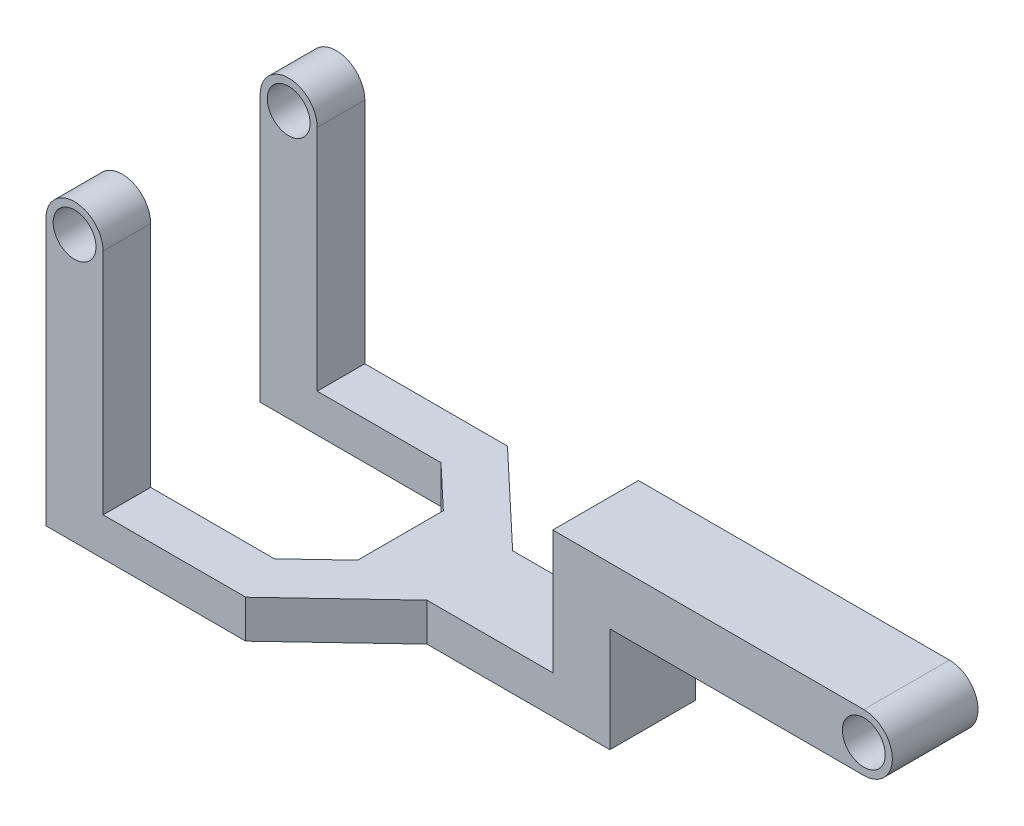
ISO-10303-21;
HEADER;
FILE_DESCRIPTION(('STEP AP214'),'2;1');
FILE_NAME('part.step','',(''),(''),'','','');
FILE_SCHEMA(('AUTOMOTIVE_DESIGN { 1 0 10303 214 1 1 1 1 }'));
ENDSEC;
DATA;
#1=APPLICATION_CONTEXT('core data for automotive mechanical design processes');
#2=APPLICATION_PROTOCOL_DEFINITION('international standard','automotive_design',2000,#1);
#3=PRODUCT_CONTEXT('',#1,'mechanical');
#4=PRODUCT('Part','Part','',(#3));
#5=PRODUCT_RELATED_PRODUCT_CATEGORY('part','',(#4));
#6=PRODUCT_DEFINITION_FORMATION('','',#4);
#7=PRODUCT_DEFINITION_CONTEXT('part definition',#1,'design');
#8=PRODUCT_DEFINITION('design','',#6,#7);
#9=PRODUCT_DEFINITION_SHAPE('','',#8);
#10=(LENGTH_UNIT() NAMED_UNIT(*) SI_UNIT(.MILLI.,.METRE.));
#11=(NAMED_UNIT(*) PLANE_ANGLE_UNIT() SI_UNIT($,.RADIAN.));
#12=(NAMED_UNIT(*) SI_UNIT($,.STERADIAN.) SOLID_ANGLE_UNIT());
#13=UNCERTAINTY_MEASURE_WITH_UNIT(LENGTH_MEASURE(1.E-05),#10,'distance_accuracy_value','');
#14=(GEOMETRIC_REPRESENTATION_CONTEXT(3) GLOBAL_UNCERTAINTY_ASSIGNED_CONTEXT((#13)) GLOBAL_UNIT_ASSIGNED_CONTEXT((#10,
#11,#12)) REPRESENTATION_CONTEXT('',''));
#15=CARTESIAN_POINT('',(0.,0.,0.));
#16=DIRECTION('',(0.,0.,1.));
#17=DIRECTION('',(1.,0.,0.));
#18=AXIS2_PLACEMENT_3D('',#15,#16,#17);
#19=CARTESIAN_POINT('',(0.,0.,275.));
#20=DIRECTION('',(0.,1.,0.));
#21=DIRECTION('',(0.,0.,1.));
#22=AXIS2_PLACEMENT_3D('',#19,#20,#21);
#23=PLANE('',#22);
#24=DIRECTION('',(0.727013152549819,0.,-0.686623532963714));
#25=VECTOR('',#24,1.);
#26=CARTESIAN_POINT('',(98.9478161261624,0.,379.76827589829));
#27=LINE('',#26,#25);
#28=CARTESIAN_POINT('',(209.878931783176,0.,275.));
#29=VERTEX_POINT('',#28);
#30=CARTESIAN_POINT('',(307.820108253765,0.,182.5));
#31=VERTEX_POINT('',#30);
#32=EDGE_CURVE('E195',#29,#31,#27,.T.);
#33=ORIENTED_EDGE('',*,*,#32,.F.);
#34=DIRECTION('',(1.,0.,0.));
#35=VECTOR('',#34,1.);
#36=CARTESIAN_POINT('',(0.,0.,275.));
#37=LINE('',#36,#35);
#38=CARTESIAN_POINT('',(0.,0.,275.));
#39=VERTEX_POINT('',#38);
#40=EDGE_CURVE('E297',#39,#29,#37,.T.);
#41=ORIENTED_EDGE('',*,*,#40,.F.);
#42=DIRECTION('',(0.,0.,-1.));
#43=VECTOR('',#42,1.);
#44=CARTESIAN_POINT('',(0.,0.,275.));
#45=LINE('',#44,#43);
#46=CARTESIAN_POINT('',(0.,0.,225.));
#47=VERTEX_POINT('',#46);
#48=EDGE_CURVE('E335',#39,#47,#45,.T.);
#49=ORIENTED_EDGE('',*,*,#48,.T.);
#50=DIRECTION('',(-1.,0.,0.));
#51=VECTOR('',#50,1.);
#52=CARTESIAN_POINT('',(0.,0.,225.));
#53=LINE('',#52,#51);
#54=CARTESIAN_POINT('',(190.,0.,225.));
#55=VERTEX_POINT('',#54);
#56=EDGE_CURVE('E276',#55,#47,#53,.T.);
#57=ORIENTED_EDGE('',*,*,#56,.F.);
#58=DIRECTION('',(-0.727013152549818,0.,0.686623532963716));
#59=VECTOR('',#58,1.);
#60=CARTESIAN_POINT('',(64.6166394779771,0.,343.417618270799));
#61=LINE('',#60,#59);
#62=CARTESIAN_POINT('',(235.,0.,182.5));
#63=VERTEX_POINT('',#62);
#64=EDGE_CURVE('E282',#63,#55,#61,.T.);
#65=ORIENTED_EDGE('',*,*,#64,.F.);
#66=DIRECTION('',(0.,0.,1.));
#67=VECTOR('',#66,1.);
#68=CARTESIAN_POINT('',(235.,0.,275.));
#69=LINE('',#68,#67);
#70=CARTESIAN_POINT('',(235.,0.,92.5000000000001));
#71=VERTEX_POINT('',#70);
#72=EDGE_CURVE('E280',#71,#63,#69,.T.);
#73=ORIENTED_EDGE('',*,*,#72,.F.);
#74=DIRECTION('',(0.727013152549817,0.,0.686623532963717));
#75=VECTOR('',#74,1.);
#76=CARTESIAN_POINT('',(201.89233278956,0.,61.2316476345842));
#77=LINE('',#76,#75);
#78=CARTESIAN_POINT('',(190.,0.,50.0000000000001));
#79=VERTEX_POINT('',#78);
#80=EDGE_CURVE('E278',#79,#71,#77,.T.);
#81=ORIENTED_EDGE('',*,*,#80,.F.);
#82=DIRECTION('',(1.,0.,0.));
#83=VECTOR('',#82,1.);
#84=CARTESIAN_POINT('',(0.,0.,50.));
#85=LINE('',#84,#83);
#86=CARTESIAN_POINT('',(0.,0.,50.));
#87=VERTEX_POINT('',#86);
#88=EDGE_CURVE('E267',#87,#79,#85,.T.);
#89=ORIENTED_EDGE('',*,*,#88,.F.);
#90=CARTESIAN_POINT('',(0.,0.,0.));
#91=VERTEX_POINT('',#90);
#92=EDGE_CURVE('E334',#87,#91,#45,.T.);
#93=ORIENTED_EDGE('',*,*,#92,.T.);
#94=DIRECTION('',(1.,0.,0.));
#95=VECTOR('',#94,1.);
#96=CARTESIAN_POINT('',(0.,0.,0.));
#97=LINE('',#96,#95);
#98=CARTESIAN_POINT('',(209.878931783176,0.,0.));
#99=VERTEX_POINT('',#98);
#100=EDGE_CURVE('E309',#91,#99,#97,.T.);
#101=ORIENTED_EDGE('',*,*,#100,.T.);
#102=DIRECTION('',(-0.727013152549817,0.,-0.686623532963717));
#103=VECTOR('',#102,1.);
#104=CARTESIAN_POINT('',(236.223509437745,0.,24.8809900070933));
#105=LINE('',#104,#103);
#106=CARTESIAN_POINT('',(307.820108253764,0.,92.5000000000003));
#107=VERTEX_POINT('',#106);
#108=EDGE_CURVE('E241',#107,#99,#105,.T.);
#109=ORIENTED_EDGE('',*,*,#108,.F.);
#110=DIRECTION('',(-1.,0.,0.));
#111=VECTOR('',#110,1.);
#112=CARTESIAN_POINT('',(0.,0.,92.5000000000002));
#113=LINE('',#112,#111);
#114=CARTESIAN_POINT('',(500.,0.,92.5000000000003));
#115=VERTEX_POINT('',#114);
#116=EDGE_CURVE('E237',#115,#107,#113,.T.);
#117=ORIENTED_EDGE('',*,*,#116,.F.);
#118=DIRECTION('',(0.,0.,-1.));
#119=VECTOR('',#118,1.);
#120=CARTESIAN_POINT('',(500.,0.,275.));
#121=LINE('',#120,#119);
#122=CARTESIAN_POINT('',(500.,0.,182.5));
#123=VERTEX_POINT('',#122);
#124=EDGE_CURVE('E332',#123,#115,#121,.T.);
#125=ORIENTED_EDGE('',*,*,#124,.F.);
#126=DIRECTION('',(1.,0.,0.));
#127=VECTOR('',#126,1.);
#128=CARTESIAN_POINT('',(0.,0.,182.5));
#129=LINE('',#128,#127);
#130=EDGE_CURVE('E190',#31,#123,#129,.T.);
#131=ORIENTED_EDGE('',*,*,#130,.F.);
#132=EDGE_LOOP('',(#33,#41,#49,#57,#65,#73,#81,#89,#93,#101,#109,#117,#125,#131));
#133=FACE_BOUND('',#132,.T.);
#134=ADVANCED_FACE('F33',(#133),#23,.F.);
#135=CARTESIAN_POINT('',(440.,40.,275.));
#136=DIRECTION('',(0.,-1.,0.));
#137=DIRECTION('',(1.,0.,0.));
#138=AXIS2_PLACEMENT_3D('',#135,#136,#137);
#139=PLANE('',#138);
#140=DIRECTION('',(-0.727013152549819,0.,0.686623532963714));
#141=VECTOR('',#140,1.);
#142=CARTESIAN_POINT('',(331.50899067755,40.,160.127166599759));
#143=LINE('',#142,#141);
#144=CARTESIAN_POINT('',(307.820108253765,40.,182.5));
#145=VERTEX_POINT('',#144);
#146=CARTESIAN_POINT('',(209.878931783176,40.,275.));
#147=VERTEX_POINT('',#146);
#148=EDGE_CURVE('E49',#145,#147,#143,.T.);
#149=ORIENTED_EDGE('',*,*,#148,.F.);
#150=DIRECTION('',(-1.,0.,0.));
#151=VECTOR('',#150,1.);
#152=CARTESIAN_POINT('',(440.,40.,182.5));
#153=LINE('',#152,#151);
#154=CARTESIAN_POINT('',(440.,40.,182.5));
#155=VERTEX_POINT('',#154);
#156=EDGE_CURVE('E184',#155,#145,#153,.T.);
#157=ORIENTED_EDGE('',*,*,#156,.F.);
#158=DIRECTION('',(0.,0.,-1.));
#159=VECTOR('',#158,1.);
#160=CARTESIAN_POINT('',(440.,40.,275.));
#161=LINE('',#160,#159);
#162=CARTESIAN_POINT('',(440.,40.,92.5000000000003));
#163=VERTEX_POINT('',#162);
#164=EDGE_CURVE('E56',#155,#163,#161,.T.);
#165=ORIENTED_EDGE('',*,*,#164,.T.);
#166=DIRECTION('',(1.,0.,0.));
#167=VECTOR('',#166,1.);
#168=CARTESIAN_POINT('',(440.,40.,92.5000000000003));
#169=LINE('',#168,#167);
#170=CARTESIAN_POINT('',(307.820108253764,40.,92.5000000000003));
#171=VERTEX_POINT('',#170);
#172=EDGE_CURVE('E235',#171,#163,#169,.T.);
#173=ORIENTED_EDGE('',*,*,#172,.F.);
#174=DIRECTION('',(0.727013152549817,0.,0.686623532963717));
#175=VECTOR('',#174,1.);
#176=CARTESIAN_POINT('',(468.784683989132,40.,244.522099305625));
#177=LINE('',#176,#175);
#178=CARTESIAN_POINT('',(209.878931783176,40.,0.));
#179=VERTEX_POINT('',#178);
#180=EDGE_CURVE('E239',#179,#171,#177,.T.);
#181=ORIENTED_EDGE('',*,*,#180,.F.);
#182=DIRECTION('',(-1.,0.,0.));
#183=VECTOR('',#182,1.);
#184=CARTESIAN_POINT('',(440.,40.,0.));
#185=LINE('',#184,#183);
#186=CARTESIAN_POINT('',(59.9999999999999,40.,0.));
#187=VERTEX_POINT('',#186);
#188=EDGE_CURVE('E312',#179,#187,#185,.T.);
#189=ORIENTED_EDGE('',*,*,#188,.T.);
#190=DIRECTION('',(0.,0.,-1.));
#191=VECTOR('',#190,1.);
#192=CARTESIAN_POINT('',(59.9999999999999,40.,275.));
#193=LINE('',#192,#191);
#194=CARTESIAN_POINT('',(59.9999999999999,40.,50.));
#195=VERTEX_POINT('',#194);
#196=EDGE_CURVE('E319',#195,#187,#193,.T.);
#197=ORIENTED_EDGE('',*,*,#196,.F.);
#198=DIRECTION('',(-1.,0.,0.));
#199=VECTOR('',#198,1.);
#200=CARTESIAN_POINT('',(440.,40.,50.0000000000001));
#201=LINE('',#200,#199);
#202=CARTESIAN_POINT('',(190.,40.,50.0000000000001));
#203=VERTEX_POINT('',#202);
#204=EDGE_CURVE('E263',#203,#195,#201,.T.);
#205=ORIENTED_EDGE('',*,*,#204,.F.);
#206=DIRECTION('',(-0.727013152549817,0.,-0.686623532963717));
#207=VECTOR('',#206,1.);
#208=CARTESIAN_POINT('',(434.453507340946,40.,280.872756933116));
#209=LINE('',#208,#207);
#210=CARTESIAN_POINT('',(235.,40.,92.5000000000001));
#211=VERTEX_POINT('',#210);
#212=EDGE_CURVE('E342',#211,#203,#209,.T.);
#213=ORIENTED_EDGE('',*,*,#212,.F.);
#214=DIRECTION('',(0.,0.,-1.));
#215=VECTOR('',#214,1.);
#216=CARTESIAN_POINT('',(235.,40.,275.));
#217=LINE('',#216,#215);
#218=CARTESIAN_POINT('',(235.,40.,182.5));
#219=VERTEX_POINT('',#218);
#220=EDGE_CURVE('E348',#219,#211,#217,.T.);
#221=ORIENTED_EDGE('',*,*,#220,.F.);
#222=DIRECTION('',(0.727013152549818,0.,-0.686623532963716));
#223=VECTOR('',#222,1.);
#224=CARTESIAN_POINT('',(297.177814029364,40.,123.776508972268));
#225=LINE('',#224,#223);
#226=CARTESIAN_POINT('',(190.,40.,225.));
#227=VERTEX_POINT('',#226);
#228=EDGE_CURVE('E42',#227,#219,#225,.T.);
#229=ORIENTED_EDGE('',*,*,#228,.F.);
#230=DIRECTION('',(1.,0.,0.));
#231=VECTOR('',#230,1.);
#232=CARTESIAN_POINT('',(440.,40.,225.));
#233=LINE('',#232,#231);
#234=CARTESIAN_POINT('',(59.9999999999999,40.,225.));
#235=VERTEX_POINT('',#234);
#236=EDGE_CURVE('E272',#235,#227,#233,.T.);
#237=ORIENTED_EDGE('',*,*,#236,.F.);
#238=CARTESIAN_POINT('',(59.9999999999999,40.,275.));
#239=VERTEX_POINT('',#238);
#240=EDGE_CURVE('E320',#239,#235,#193,.T.);
#241=ORIENTED_EDGE('',*,*,#240,.F.);
#242=DIRECTION('',(-1.,0.,0.));
#243=VECTOR('',#242,1.);
#244=CARTESIAN_POINT('',(440.,40.,275.));
#245=LINE('',#244,#243);
#246=EDGE_CURVE('E200',#147,#239,#245,.T.);
#247=ORIENTED_EDGE('',*,*,#246,.F.);
#248=EDGE_LOOP('',(#149,#157,#165,#173,#181,#189,#197,#205,#213,#221,#229,#237,#241,#247));
#249=FACE_BOUND('',#248,.T.);
#250=ADVANCED_FACE('F198',(#249),#139,.F.);
#251=CARTESIAN_POINT('',(500.,0.,275.));
#252=DIRECTION('',(-1.,0.,0.));
#253=DIRECTION('',(0.,0.,1.));
#254=AXIS2_PLACEMENT_3D('',#251,#252,#253);
#255=PLANE('',#254);
#256=DIRECTION('',(0.,1.,0.));
#257=VECTOR('',#256,1.);
#258=CARTESIAN_POINT('',(500.,0.,182.5));
#259=LINE('',#258,#257);
#260=CARTESIAN_POINT('',(500.,110.,182.5));
#261=VERTEX_POINT('',#260);
#262=EDGE_CURVE('E191',#123,#261,#259,.T.);
#263=ORIENTED_EDGE('',*,*,#262,.F.);
#264=ORIENTED_EDGE('',*,*,#124,.T.);
#265=DIRECTION('',(0.,-1.,0.));
#266=VECTOR('',#265,1.);
#267=CARTESIAN_POINT('',(500.,0.,92.5000000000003));
#268=LINE('',#267,#266);
#269=CARTESIAN_POINT('',(500.,110.,92.5000000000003));
#270=VERTEX_POINT('',#269);
#271=EDGE_CURVE('E232',#270,#115,#268,.T.);
#272=ORIENTED_EDGE('',*,*,#271,.F.);
#273=DIRECTION('',(0.,0.,-1.));
#274=VECTOR('',#273,1.);
#275=CARTESIAN_POINT('',(500.,110.,275.));
#276=LINE('',#275,#274);
#277=EDGE_CURVE('E330',#261,#270,#276,.T.);
#278=ORIENTED_EDGE('',*,*,#277,.F.);
#279=EDGE_LOOP('',(#263,#264,#272,#278));
#280=FACE_BOUND('',#279,.T.);
#281=ADVANCED_FACE('F402',(#280),#255,.F.);
#282=CARTESIAN_POINT('',(766.800007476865,110.,275.));
#283=DIRECTION('',(0.,1.,0.));
#284=DIRECTION('',(0.,0.,1.));
#285=AXIS2_PLACEMENT_3D('',#282,#283,#284);
#286=PLANE('',#285);
#287=DIRECTION('',(1.,0.,0.));
#288=VECTOR('',#287,1.);
#289=CARTESIAN_POINT('',(766.800007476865,110.,182.5));
#290=LINE('',#289,#288);
#291=CARTESIAN_POINT('',(766.800007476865,110.,182.5));
#292=VERTEX_POINT('',#291);
#293=EDGE_CURVE('E209',#261,#292,#290,.T.);
#294=ORIENTED_EDGE('',*,*,#293,.F.);
#295=ORIENTED_EDGE('',*,*,#277,.T.);
#296=DIRECTION('',(-1.,0.,0.));
#297=VECTOR('',#296,1.);
#298=CARTESIAN_POINT('',(766.800007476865,110.,92.5000000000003));
#299=LINE('',#298,#297);
#300=CARTESIAN_POINT('',(766.800007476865,110.,92.5000000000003));
#301=VERTEX_POINT('',#300);
#302=EDGE_CURVE('E229',#301,#270,#299,.T.);
#303=ORIENTED_EDGE('',*,*,#302,.F.);
#304=DIRECTION('',(0.,0.,-1.));
#305=VECTOR('',#304,1.);
#306=CARTESIAN_POINT('',(766.800007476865,110.,275.));
#307=LINE('',#306,#305);
#308=EDGE_CURVE('E328',#292,#301,#307,.T.);
#309=ORIENTED_EDGE('',*,*,#308,.F.);
#310=EDGE_LOOP('',(#294,#295,#303,#309));
#311=FACE_BOUND('',#310,.T.);
#312=ADVANCED_FACE('F398',(#311),#286,.F.);
#313=CARTESIAN_POINT('',(766.8,140.,275.));
#314=DIRECTION('',(0.,0.,-1.));
#315=DIRECTION('',(-1.,0.,0.));
#316=AXIS2_PLACEMENT_3D('',#313,#314,#315);
#317=CYLINDRICAL_SURFACE('',#316,30.0000000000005);
#318=CARTESIAN_POINT('',(766.8,140.,182.5));
#319=DIRECTION('',(0.,0.,1.));
#320=DIRECTION('',(1.,0.,0.));
#321=AXIS2_PLACEMENT_3D('',#318,#319,#320);
#322=CIRCLE('',#321,30.0000000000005);
#323=CARTESIAN_POINT('',(766.8,170.,182.5));
#324=VERTEX_POINT('',#323);
#325=EDGE_CURVE('E207',#292,#324,#322,.T.);
#326=ORIENTED_EDGE('',*,*,#325,.F.);
#327=ORIENTED_EDGE('',*,*,#308,.T.);
#328=CARTESIAN_POINT('',(766.8,140.,92.5000000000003));
#329=DIRECTION('',(0.,0.,-1.));
#330=DIRECTION('',(-1.,0.,0.));
#331=AXIS2_PLACEMENT_3D('',#328,#329,#330);
#332=CIRCLE('',#331,30.0000000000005);
#333=CARTESIAN_POINT('',(766.8,170.,92.5000000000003));
#334=VERTEX_POINT('',#333);
#335=EDGE_CURVE('E226',#334,#301,#332,.T.);
#336=ORIENTED_EDGE('',*,*,#335,.F.);
#337=DIRECTION('',(0.,0.,-1.));
#338=VECTOR('',#337,1.);
#339=CARTESIAN_POINT('',(766.8,170.,275.));
#340=LINE('',#339,#338);
#341=EDGE_CURVE('E326',#324,#334,#340,.T.);
#342=ORIENTED_EDGE('',*,*,#341,.F.);
#343=EDGE_LOOP('',(#326,#327,#336,#342));
#344=FACE_BOUND('',#343,.T.);
#345=ADVANCED_FACE('F394',(#344),#317,.T.);
#346=CARTESIAN_POINT('',(440.,170.,275.));
#347=DIRECTION('',(0.,-1.,0.));
#348=DIRECTION('',(1.,0.,0.));
#349=AXIS2_PLACEMENT_3D('',#346,#347,#348);
#350=PLANE('',#349);
#351=DIRECTION('',(-1.,0.,0.));
#352=VECTOR('',#351,1.);
#353=CARTESIAN_POINT('',(440.,170.,182.5));
#354=LINE('',#353,#352);
#355=CARTESIAN_POINT('',(440.,170.,182.5));
#356=VERTEX_POINT('',#355);
#357=EDGE_CURVE('E205',#324,#356,#354,.T.);
#358=ORIENTED_EDGE('',*,*,#357,.F.);
#359=ORIENTED_EDGE('',*,*,#341,.T.);
#360=DIRECTION('',(1.,0.,0.));
#361=VECTOR('',#360,1.);
#362=CARTESIAN_POINT('',(440.,170.,92.5000000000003));
#363=LINE('',#362,#361);
#364=CARTESIAN_POINT('',(440.,170.,92.5000000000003));
#365=VERTEX_POINT('',#364);
#366=EDGE_CURVE('E223',#365,#334,#363,.T.);
#367=ORIENTED_EDGE('',*,*,#366,.F.);
#368=DIRECTION('',(0.,0.,-1.));
#369=VECTOR('',#368,1.);
#370=CARTESIAN_POINT('',(440.,170.,275.));
#371=LINE('',#370,#369);
#372=EDGE_CURVE('E324',#356,#365,#371,.T.);
#373=ORIENTED_EDGE('',*,*,#372,.F.);
#374=EDGE_LOOP('',(#358,#359,#367,#373));
#375=FACE_BOUND('',#374,.T.);
#376=ADVANCED_FACE('F388',(#375),#350,.F.);
#377=CARTESIAN_POINT('',(440.,40.,275.));
#378=DIRECTION('',(1.,0.,0.));
#379=DIRECTION('',(0.,0.,-1.));
#380=AXIS2_PLACEMENT_3D('',#377,#378,#379);
#381=PLANE('',#380);
#382=DIRECTION('',(0.,-1.,0.));
#383=VECTOR('',#382,1.);
#384=CARTESIAN_POINT('',(440.,40.,182.5));
#385=LINE('',#384,#383);
#386=EDGE_CURVE('E189',#356,#155,#385,.T.);
#387=ORIENTED_EDGE('',*,*,#386,.F.);
#388=ORIENTED_EDGE('',*,*,#372,.T.);
#389=DIRECTION('',(0.,1.,0.));
#390=VECTOR('',#389,1.);
#391=CARTESIAN_POINT('',(440.,40.,92.5000000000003));
#392=LINE('',#391,#390);
#393=EDGE_CURVE('E220',#163,#365,#392,.T.);
#394=ORIENTED_EDGE('',*,*,#393,.F.);
#395=ORIENTED_EDGE('',*,*,#164,.F.);
#396=EDGE_LOOP('',(#387,#388,#394,#395));
#397=FACE_BOUND('',#396,.T.);
#398=ADVANCED_FACE('F384',(#397),#381,.F.);
#399=CARTESIAN_POINT('',(766.8,140.,275.));
#400=DIRECTION('',(0.,0.,-1.));
#401=DIRECTION('',(-1.,0.,0.));
#402=AXIS2_PLACEMENT_3D('',#399,#400,#401);
#403=CYLINDRICAL_SURFACE('',#402,22.5);
#404=CARTESIAN_POINT('',(766.8,140.,92.5000000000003));
#405=DIRECTION('',(0.,0.,-1.));
#406=DIRECTION('',(-1.,0.,0.));
#407=AXIS2_PLACEMENT_3D('',#404,#405,#406);
#408=CIRCLE('',#407,22.5);
#409=CARTESIAN_POINT('',(744.3,140.,92.5000000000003));
#410=VERTEX_POINT('',#409);
#411=EDGE_CURVE('E219',#410,#410,#408,.T.);
#412=ORIENTED_EDGE('',*,*,#411,.T.);
#413=EDGE_LOOP('',(#412));
#414=FACE_BOUND('',#413,.T.);
#415=CARTESIAN_POINT('',(766.8,140.,182.5));
#416=DIRECTION('',(0.,0.,1.));
#417=DIRECTION('',(1.,0.,0.));
#418=AXIS2_PLACEMENT_3D('',#415,#416,#417);
#419=CIRCLE('',#418,22.5);
#420=CARTESIAN_POINT('',(789.3,140.,182.5));
#421=VERTEX_POINT('',#420);
#422=EDGE_CURVE('E37',#421,#421,#419,.T.);
#423=ORIENTED_EDGE('',*,*,#422,.T.);
#424=EDGE_LOOP('',(#423));
#425=FACE_BOUND('',#424,.T.);
#426=ADVANCED_FACE('F354',(#414,#425),#403,.F.);
#427=CARTESIAN_POINT('',(29.9999999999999,280.,275.));
#428=DIRECTION('',(0.,0.,1.));
#429=DIRECTION('',(1.,0.,0.));
#430=AXIS2_PLACEMENT_3D('',#427,#428,#429);
#431=PLANE('',#430);
#432=CARTESIAN_POINT('',(29.9999999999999,280.,275.));
#433=DIRECTION('',(0.,0.,1.));
#434=DIRECTION('',(1.,0.,0.));
#435=AXIS2_PLACEMENT_3D('',#432,#433,#434);
#436=CIRCLE('',#435,22.5);
#437=CARTESIAN_POINT('',(52.5,280.,275.));
#438=VERTEX_POINT('',#437);
#439=EDGE_CURVE('E285',#438,#438,#436,.T.);
#440=ORIENTED_EDGE('',*,*,#439,.F.);
#441=EDGE_LOOP('',(#440));
#442=FACE_BOUND('',#441,.T.);
#443=ORIENTED_EDGE('',*,*,#40,.T.);
#444=DIRECTION('',(0.,1.,0.));
#445=VECTOR('',#444,1.);
#446=CARTESIAN_POINT('',(209.878931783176,280.,275.));
#447=LINE('',#446,#445);
#448=EDGE_CURVE('E11',#29,#147,#447,.T.);
#449=ORIENTED_EDGE('',*,*,#448,.T.);
#450=ORIENTED_EDGE('',*,*,#246,.T.);
#451=DIRECTION('',(0.,1.,0.));
#452=VECTOR('',#451,1.);
#453=CARTESIAN_POINT('',(59.9999999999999,40.,275.));
#454=LINE('',#453,#452);
#455=CARTESIAN_POINT('',(59.9999999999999,280.,275.));
#456=VERTEX_POINT('',#455);
#457=EDGE_CURVE('E301',#239,#456,#454,.T.);
#458=ORIENTED_EDGE('',*,*,#457,.T.);
#459=CARTESIAN_POINT('',(29.9999999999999,280.,275.));
#460=DIRECTION('',(0.,0.,1.));
#461=DIRECTION('',(1.,0.,0.));
#462=AXIS2_PLACEMENT_3D('',#459,#460,#461);
#463=CIRCLE('',#462,30.);
#464=CARTESIAN_POINT('',(0.,280.,275.));
#465=VERTEX_POINT('',#464);
#466=EDGE_CURVE('E291',#456,#465,#463,.T.);
#467=ORIENTED_EDGE('',*,*,#466,.T.);
#468=DIRECTION('',(0.,-1.,0.));
#469=VECTOR('',#468,1.);
#470=CARTESIAN_POINT('',(0.,280.,275.));
#471=LINE('',#470,#469);
#472=EDGE_CURVE('E294',#465,#39,#471,.T.);
#473=ORIENTED_EDGE('',*,*,#472,.T.);
#474=EDGE_LOOP('',(#443,#449,#450,#458,#467,#473));
#475=FACE_BOUND('',#474,.T.);
#476=ADVANCED_FACE('F405',(#442,#475),#431,.T.);
#477=CARTESIAN_POINT('',(29.9999999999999,280.,0.));
#478=DIRECTION('',(0.,0.,1.));
#479=DIRECTION('',(1.,0.,0.));
#480=AXIS2_PLACEMENT_3D('',#477,#478,#479);
#481=PLANE('',#480);
#482=CARTESIAN_POINT('',(29.9999999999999,280.,0.));
#483=DIRECTION('',(0.,0.,1.));
#484=DIRECTION('',(1.,0.,0.));
#485=AXIS2_PLACEMENT_3D('',#482,#483,#484);
#486=CIRCLE('',#485,22.5);
#487=CARTESIAN_POINT('',(52.5,280.,0.));
#488=VERTEX_POINT('',#487);
#489=EDGE_CURVE('E284',#488,#488,#486,.T.);
#490=ORIENTED_EDGE('',*,*,#489,.T.);
#491=EDGE_LOOP('',(#490));
#492=FACE_BOUND('',#491,.T.);
#493=DIRECTION('',(0.,-1.,0.));
#494=VECTOR('',#493,1.);
#495=CARTESIAN_POINT('',(209.878931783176,315.,0.));
#496=LINE('',#495,#494);
#497=EDGE_CURVE('E216',#179,#99,#496,.T.);
#498=ORIENTED_EDGE('',*,*,#497,.T.);
#499=ORIENTED_EDGE('',*,*,#100,.F.);
#500=DIRECTION('',(0.,-1.,0.));
#501=VECTOR('',#500,1.);
#502=CARTESIAN_POINT('',(0.,280.,0.));
#503=LINE('',#502,#501);
#504=CARTESIAN_POINT('',(0.,280.,0.));
#505=VERTEX_POINT('',#504);
#506=EDGE_CURVE('E306',#505,#91,#503,.T.);
#507=ORIENTED_EDGE('',*,*,#506,.F.);
#508=CARTESIAN_POINT('',(29.9999999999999,280.,0.));
#509=DIRECTION('',(0.,0.,1.));
#510=DIRECTION('',(1.,0.,0.));
#511=AXIS2_PLACEMENT_3D('',#508,#509,#510);
#512=CIRCLE('',#511,30.);
#513=CARTESIAN_POINT('',(59.9999999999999,280.,0.));
#514=VERTEX_POINT('',#513);
#515=EDGE_CURVE('E288',#514,#505,#512,.T.);
#516=ORIENTED_EDGE('',*,*,#515,.F.);
#517=DIRECTION('',(0.,1.,0.));
#518=VECTOR('',#517,1.);
#519=CARTESIAN_POINT('',(59.9999999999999,40.,0.));
#520=LINE('',#519,#518);
#521=EDGE_CURVE('E295',#187,#514,#520,.T.);
#522=ORIENTED_EDGE('',*,*,#521,.F.);
#523=ORIENTED_EDGE('',*,*,#188,.F.);
#524=EDGE_LOOP('',(#498,#499,#507,#516,#522,#523));
#525=FACE_BOUND('',#524,.T.);
#526=ADVANCED_FACE('F375',(#492,#525),#481,.F.);
#527=CARTESIAN_POINT('',(29.9999999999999,280.,275.));
#528=DIRECTION('',(0.,0.,-1.));
#529=DIRECTION('',(-1.,0.,0.));
#530=AXIS2_PLACEMENT_3D('',#527,#528,#529);
#531=CYLINDRICAL_SURFACE('',#530,30.);
#532=CARTESIAN_POINT('',(29.9999999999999,280.,225.));
#533=DIRECTION('',(0.,0.,-1.));
#534=DIRECTION('',(-1.,0.,0.));
#535=AXIS2_PLACEMENT_3D('',#532,#533,#534);
#536=CIRCLE('',#535,30.);
#537=CARTESIAN_POINT('',(0.,280.,225.));
#538=VERTEX_POINT('',#537);
#539=CARTESIAN_POINT('',(59.9999999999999,280.,225.));
#540=VERTEX_POINT('',#539);
#541=EDGE_CURVE('E274',#538,#540,#536,.T.);
#542=ORIENTED_EDGE('',*,*,#541,.F.);
#543=DIRECTION('',(0.,0.,-1.));
#544=VECTOR('',#543,1.);
#545=CARTESIAN_POINT('',(0.,280.,275.));
#546=LINE('',#545,#544);
#547=EDGE_CURVE('E339',#465,#538,#546,.T.);
#548=ORIENTED_EDGE('',*,*,#547,.F.);
#549=ORIENTED_EDGE('',*,*,#466,.F.);
#550=DIRECTION('',(0.,0.,-1.));
#551=VECTOR('',#550,1.);
#552=CARTESIAN_POINT('',(59.9999999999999,280.,275.));
#553=LINE('',#552,#551);
#554=EDGE_CURVE('E316',#456,#540,#553,.T.);
#555=ORIENTED_EDGE('',*,*,#554,.T.);
#556=EDGE_LOOP('',(#542,#548,#549,#555));
#557=FACE_BOUND('',#556,.T.);
#558=ADVANCED_FACE('F35',(#557),#531,.T.);
#559=CARTESIAN_POINT('',(29.9999999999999,280.,50.));
#560=DIRECTION('',(0.,0.,1.));
#561=DIRECTION('',(1.,0.,0.));
#562=AXIS2_PLACEMENT_3D('',#559,#560,#561);
#563=CIRCLE('',#562,30.);
#564=CARTESIAN_POINT('',(59.9999999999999,280.,50.));
#565=VERTEX_POINT('',#564);
#566=CARTESIAN_POINT('',(0.,280.,50.));
#567=VERTEX_POINT('',#566);
#568=EDGE_CURVE('E265',#565,#567,#563,.T.);
#569=ORIENTED_EDGE('',*,*,#568,.F.);
#570=EDGE_CURVE('E303',#565,#514,#553,.T.);
#571=ORIENTED_EDGE('',*,*,#570,.T.);
#572=ORIENTED_EDGE('',*,*,#515,.T.);
#573=EDGE_CURVE('E338',#567,#505,#546,.T.);
#574=ORIENTED_EDGE('',*,*,#573,.F.);
#575=EDGE_LOOP('',(#569,#571,#572,#574));
#576=FACE_BOUND('',#575,.T.);
#577=ADVANCED_FACE('F440',(#576),#531,.T.);
#578=CARTESIAN_POINT('',(0.,280.,275.));
#579=DIRECTION('',(1.,0.,0.));
#580=DIRECTION('',(0.,1.,0.));
#581=AXIS2_PLACEMENT_3D('',#578,#579,#580);
#582=PLANE('',#581);
#583=DIRECTION('',(0.,-1.,0.));
#584=VECTOR('',#583,1.);
#585=CARTESIAN_POINT('',(0.,315.,225.));
#586=LINE('',#585,#584);
#587=EDGE_CURVE('E257',#538,#47,#586,.T.);
#588=ORIENTED_EDGE('',*,*,#587,.T.);
#589=ORIENTED_EDGE('',*,*,#48,.F.);
#590=ORIENTED_EDGE('',*,*,#472,.F.);
#591=ORIENTED_EDGE('',*,*,#547,.T.);
#592=EDGE_LOOP('',(#588,#589,#590,#591));
#593=FACE_BOUND('',#592,.T.);
#594=ADVANCED_FACE('F410',(#593),#582,.F.);
#595=DIRECTION('',(0.,-1.,0.));
#596=VECTOR('',#595,1.);
#597=CARTESIAN_POINT('',(0.,315.,50.));
#598=LINE('',#597,#596);
#599=EDGE_CURVE('E243',#567,#87,#598,.T.);
#600=ORIENTED_EDGE('',*,*,#599,.F.);
#601=ORIENTED_EDGE('',*,*,#573,.T.);
#602=ORIENTED_EDGE('',*,*,#506,.T.);
#603=ORIENTED_EDGE('',*,*,#92,.F.);
#604=EDGE_LOOP('',(#600,#601,#602,#603));
#605=FACE_BOUND('',#604,.T.);
#606=ADVANCED_FACE('F436',(#605),#582,.F.);
#607=CARTESIAN_POINT('',(59.9999999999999,40.,275.));
#608=DIRECTION('',(-1.,0.,0.));
#609=DIRECTION('',(0.,0.,1.));
#610=AXIS2_PLACEMENT_3D('',#607,#608,#609);
#611=PLANE('',#610);
#612=DIRECTION('',(0.,-1.,0.));
#613=VECTOR('',#612,1.);
#614=CARTESIAN_POINT('',(59.9999999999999,40.,225.));
#615=LINE('',#614,#613);
#616=EDGE_CURVE('E270',#540,#235,#615,.T.);
#617=ORIENTED_EDGE('',*,*,#616,.F.);
#618=ORIENTED_EDGE('',*,*,#554,.F.);
#619=ORIENTED_EDGE('',*,*,#457,.F.);
#620=ORIENTED_EDGE('',*,*,#240,.T.);
#621=EDGE_LOOP('',(#617,#618,#619,#620));
#622=FACE_BOUND('',#621,.T.);
#623=ADVANCED_FACE('F471',(#622),#611,.F.);
#624=DIRECTION('',(0.,1.,0.));
#625=VECTOR('',#624,1.);
#626=CARTESIAN_POINT('',(59.9999999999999,40.,50.));
#627=LINE('',#626,#625);
#628=EDGE_CURVE('E261',#195,#565,#627,.T.);
#629=ORIENTED_EDGE('',*,*,#628,.F.);
#630=ORIENTED_EDGE('',*,*,#196,.T.);
#631=ORIENTED_EDGE('',*,*,#521,.T.);
#632=ORIENTED_EDGE('',*,*,#570,.F.);
#633=EDGE_LOOP('',(#629,#630,#631,#632));
#634=FACE_BOUND('',#633,.T.);
#635=ADVANCED_FACE('F444',(#634),#611,.F.);
#636=CARTESIAN_POINT('',(29.9999999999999,280.,275.));
#637=DIRECTION('',(0.,0.,-1.));
#638=DIRECTION('',(-1.,0.,0.));
#639=AXIS2_PLACEMENT_3D('',#636,#637,#638);
#640=CYLINDRICAL_SURFACE('',#639,22.5);
#641=ORIENTED_EDGE('',*,*,#439,.T.);
#642=EDGE_LOOP('',(#641));
#643=FACE_BOUND('',#642,.T.);
#644=CARTESIAN_POINT('',(29.9999999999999,280.,225.));
#645=DIRECTION('',(0.,0.,-1.));
#646=DIRECTION('',(-1.,0.,0.));
#647=AXIS2_PLACEMENT_3D('',#644,#645,#646);
#648=CIRCLE('',#647,22.5);
#649=CARTESIAN_POINT('',(7.49999999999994,280.,225.));
#650=VERTEX_POINT('',#649);
#651=EDGE_CURVE('E269',#650,#650,#648,.T.);
#652=ORIENTED_EDGE('',*,*,#651,.T.);
#653=EDGE_LOOP('',(#652));
#654=FACE_BOUND('',#653,.T.);
#655=ADVANCED_FACE('F490',(#643,#654),#640,.F.);
#656=ORIENTED_EDGE('',*,*,#489,.F.);
#657=EDGE_LOOP('',(#656));
#658=FACE_BOUND('',#657,.T.);
#659=CARTESIAN_POINT('',(29.9999999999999,280.,50.));
#660=DIRECTION('',(0.,0.,1.));
#661=DIRECTION('',(1.,0.,0.));
#662=AXIS2_PLACEMENT_3D('',#659,#660,#661);
#663=CIRCLE('',#662,22.5);
#664=CARTESIAN_POINT('',(52.5,280.,50.));
#665=VERTEX_POINT('',#664);
#666=EDGE_CURVE('E260',#665,#665,#663,.T.);
#667=ORIENTED_EDGE('',*,*,#666,.T.);
#668=EDGE_LOOP('',(#667));
#669=FACE_BOUND('',#668,.T.);
#670=ADVANCED_FACE('F522',(#658,#669),#640,.F.);
#671=CARTESIAN_POINT('',(190.,315.,225.));
#672=DIRECTION('',(-0.686623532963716,0.,-0.727013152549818));
#673=DIRECTION('',(-0.727013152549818,0.,0.686623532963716));
#674=AXIS2_PLACEMENT_3D('',#671,#672,#673);
#675=PLANE('',#674);
#676=ORIENTED_EDGE('',*,*,#64,.T.);
#677=DIRECTION('',(0.,-1.,0.));
#678=VECTOR('',#677,1.);
#679=CARTESIAN_POINT('',(190.,315.,225.));
#680=LINE('',#679,#678);
#681=EDGE_CURVE('E254',#227,#55,#680,.T.);
#682=ORIENTED_EDGE('',*,*,#681,.F.);
#683=ORIENTED_EDGE('',*,*,#228,.T.);
#684=DIRECTION('',(0.,-1.,0.));
#685=VECTOR('',#684,1.);
#686=CARTESIAN_POINT('',(235.,315.,182.5));
#687=LINE('',#686,#685);
#688=EDGE_CURVE('E251',#219,#63,#687,.T.);
#689=ORIENTED_EDGE('',*,*,#688,.T.);
#690=EDGE_LOOP('',(#676,#682,#683,#689));
#691=FACE_BOUND('',#690,.T.);
#692=ADVANCED_FACE('F421',(#691),#675,.T.);
#693=CARTESIAN_POINT('',(235.,315.,92.5000000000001));
#694=DIRECTION('',(-1.,0.,0.));
#695=DIRECTION('',(0.,-1.,0.));
#696=AXIS2_PLACEMENT_3D('',#693,#694,#695);
#697=PLANE('',#696);
#698=ORIENTED_EDGE('',*,*,#72,.T.);
#699=ORIENTED_EDGE('',*,*,#688,.F.);
#700=ORIENTED_EDGE('',*,*,#220,.T.);
#701=DIRECTION('',(0.,-1.,0.));
#702=VECTOR('',#701,1.);
#703=CARTESIAN_POINT('',(235.,315.,92.5000000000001));
#704=LINE('',#703,#702);
#705=EDGE_CURVE('E248',#211,#71,#704,.T.);
#706=ORIENTED_EDGE('',*,*,#705,.T.);
#707=EDGE_LOOP('',(#698,#699,#700,#706));
#708=FACE_BOUND('',#707,.T.);
#709=ADVANCED_FACE('F428',(#708),#697,.T.);
#710=CARTESIAN_POINT('',(190.,315.,50.0000000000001));
#711=DIRECTION('',(-0.686623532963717,0.,0.727013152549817));
#712=DIRECTION('',(0.727013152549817,0.,0.686623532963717));
#713=AXIS2_PLACEMENT_3D('',#710,#711,#712);
#714=PLANE('',#713);
#715=ORIENTED_EDGE('',*,*,#80,.T.);
#716=ORIENTED_EDGE('',*,*,#705,.F.);
#717=ORIENTED_EDGE('',*,*,#212,.T.);
#718=DIRECTION('',(0.,-1.,0.));
#719=VECTOR('',#718,1.);
#720=CARTESIAN_POINT('',(190.,315.,50.0000000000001));
#721=LINE('',#720,#719);
#722=EDGE_CURVE('E245',#203,#79,#721,.T.);
#723=ORIENTED_EDGE('',*,*,#722,.T.);
#724=EDGE_LOOP('',(#715,#716,#717,#723));
#725=FACE_BOUND('',#724,.T.);
#726=ADVANCED_FACE('F430',(#725),#714,.T.);
#727=CARTESIAN_POINT('',(0.,315.,225.));
#728=DIRECTION('',(0.,0.,-1.));
#729=DIRECTION('',(-1.,0.,0.));
#730=AXIS2_PLACEMENT_3D('',#727,#728,#729);
#731=PLANE('',#730);
#732=ORIENTED_EDGE('',*,*,#651,.F.);
#733=EDGE_LOOP('',(#732));
#734=FACE_BOUND('',#733,.T.);
#735=ORIENTED_EDGE('',*,*,#56,.T.);
#736=ORIENTED_EDGE('',*,*,#587,.F.);
#737=ORIENTED_EDGE('',*,*,#541,.T.);
#738=ORIENTED_EDGE('',*,*,#616,.T.);
#739=ORIENTED_EDGE('',*,*,#236,.T.);
#740=ORIENTED_EDGE('',*,*,#681,.T.);
#741=EDGE_LOOP('',(#735,#736,#737,#738,#739,#740));
#742=FACE_BOUND('',#741,.T.);
#743=ADVANCED_FACE('F415',(#734,#742),#731,.T.);
#744=CARTESIAN_POINT('',(0.,315.,50.));
#745=DIRECTION('',(0.,0.,1.));
#746=DIRECTION('',(1.,0.,0.));
#747=AXIS2_PLACEMENT_3D('',#744,#745,#746);
#748=PLANE('',#747);
#749=ORIENTED_EDGE('',*,*,#666,.F.);
#750=EDGE_LOOP('',(#749));
#751=FACE_BOUND('',#750,.T.);
#752=ORIENTED_EDGE('',*,*,#88,.T.);
#753=ORIENTED_EDGE('',*,*,#722,.F.);
#754=ORIENTED_EDGE('',*,*,#204,.T.);
#755=ORIENTED_EDGE('',*,*,#628,.T.);
#756=ORIENTED_EDGE('',*,*,#568,.T.);
#757=ORIENTED_EDGE('',*,*,#599,.T.);
#758=EDGE_LOOP('',(#752,#753,#754,#755,#756,#757));
#759=FACE_BOUND('',#758,.T.);
#760=ADVANCED_FACE('F445',(#751,#759),#748,.T.);
#761=CARTESIAN_POINT('',(209.878931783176,315.,0.));
#762=DIRECTION('',(0.686623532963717,0.,-0.727013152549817));
#763=DIRECTION('',(-0.727013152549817,0.,-0.686623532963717));
#764=AXIS2_PLACEMENT_3D('',#761,#762,#763);
#765=PLANE('',#764);
#766=ORIENTED_EDGE('',*,*,#108,.T.);
#767=ORIENTED_EDGE('',*,*,#497,.F.);
#768=ORIENTED_EDGE('',*,*,#180,.T.);
#769=DIRECTION('',(0.,-1.,0.));
#770=VECTOR('',#769,1.);
#771=CARTESIAN_POINT('',(307.820108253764,315.,92.5000000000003));
#772=LINE('',#771,#770);
#773=EDGE_CURVE('E213',#171,#107,#772,.T.);
#774=ORIENTED_EDGE('',*,*,#773,.T.);
#775=EDGE_LOOP('',(#766,#767,#768,#774));
#776=FACE_BOUND('',#775,.T.);
#777=ADVANCED_FACE('F360',(#776),#765,.T.);
#778=CARTESIAN_POINT('',(909.878931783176,315.,92.5000000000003));
#779=DIRECTION('',(0.,0.,-1.));
#780=DIRECTION('',(-1.,0.,0.));
#781=AXIS2_PLACEMENT_3D('',#778,#779,#780);
#782=PLANE('',#781);
#783=ORIENTED_EDGE('',*,*,#411,.F.);
#784=EDGE_LOOP('',(#783));
#785=FACE_BOUND('',#784,.T.);
#786=ORIENTED_EDGE('',*,*,#116,.T.);
#787=ORIENTED_EDGE('',*,*,#773,.F.);
#788=ORIENTED_EDGE('',*,*,#172,.T.);
#789=ORIENTED_EDGE('',*,*,#393,.T.);
#790=ORIENTED_EDGE('',*,*,#366,.T.);
#791=ORIENTED_EDGE('',*,*,#335,.T.);
#792=ORIENTED_EDGE('',*,*,#302,.T.);
#793=ORIENTED_EDGE('',*,*,#271,.T.);
#794=EDGE_LOOP('',(#786,#787,#788,#789,#790,#791,#792,#793));
#795=FACE_BOUND('',#794,.T.);
#796=ADVANCED_FACE('F357',(#785,#795),#782,.T.);
#797=CARTESIAN_POINT('',(307.820108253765,315.,182.5));
#798=DIRECTION('',(0.,0.,1.));
#799=DIRECTION('',(1.,0.,0.));
#800=AXIS2_PLACEMENT_3D('',#797,#798,#799);
#801=PLANE('',#800);
#802=ORIENTED_EDGE('',*,*,#422,.F.);
#803=EDGE_LOOP('',(#802));
#804=FACE_BOUND('',#803,.T.);
#805=ORIENTED_EDGE('',*,*,#130,.T.);
#806=ORIENTED_EDGE('',*,*,#262,.T.);
#807=ORIENTED_EDGE('',*,*,#293,.T.);
#808=ORIENTED_EDGE('',*,*,#325,.T.);
#809=ORIENTED_EDGE('',*,*,#357,.T.);
#810=ORIENTED_EDGE('',*,*,#386,.T.);
#811=ORIENTED_EDGE('',*,*,#156,.T.);
#812=DIRECTION('',(0.,-1.,0.));
#813=VECTOR('',#812,1.);
#814=CARTESIAN_POINT('',(307.820108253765,315.,182.5));
#815=LINE('',#814,#813);
#816=EDGE_CURVE('E186',#145,#31,#815,.T.);
#817=ORIENTED_EDGE('',*,*,#816,.T.);
#818=EDGE_LOOP('',(#805,#806,#807,#808,#809,#810,#811,#817));
#819=FACE_BOUND('',#818,.T.);
#820=ADVANCED_FACE('F185',(#804,#819),#801,.T.);
#821=CARTESIAN_POINT('',(307.820108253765,315.,182.5));
#822=DIRECTION('',(0.686623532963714,0.,0.727013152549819));
#823=DIRECTION('',(0.727013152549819,0.,-0.686623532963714));
#824=AXIS2_PLACEMENT_3D('',#821,#822,#823);
#825=PLANE('',#824);
#826=ORIENTED_EDGE('',*,*,#32,.T.);
#827=ORIENTED_EDGE('',*,*,#816,.F.);
#828=ORIENTED_EDGE('',*,*,#148,.T.);
#829=ORIENTED_EDGE('',*,*,#448,.F.);
#830=EDGE_LOOP('',(#826,#827,#828,#829));
#831=FACE_BOUND('',#830,.T.);
#832=ADVANCED_FACE('F193',(#831),#825,.T.);
#833=CLOSED_SHELL('',(#134,#250,#281,#312,#345,#376,#398,#426,#476,#526,#558,#577,#594,#606,
#623,#635,#655,#670,#692,#709,#726,#743,#760,#777,#796,#820,#832));
#834=MANIFOLD_SOLID_BREP('B2',#833);
#835=ADVANCED_BREP_SHAPE_REPRESENTATION('',(#18,#834),#14);
#836=SHAPE_DEFINITION_REPRESENTATION(#9,#835);
ENDSEC;
END-ISO-10303-21;
